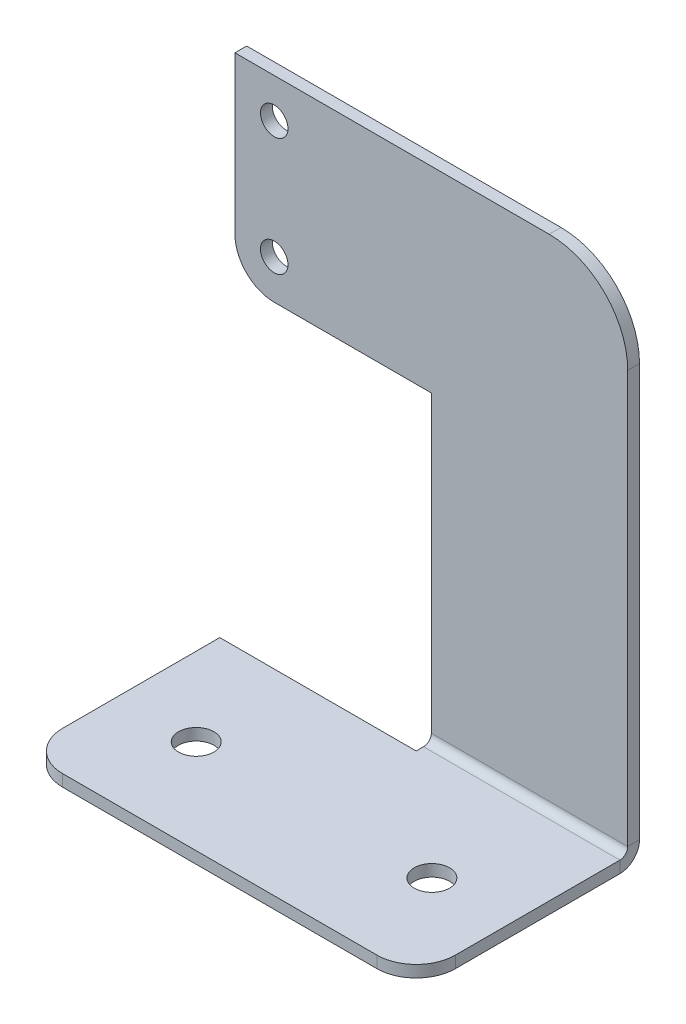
ISO-10303-21;
HEADER;
FILE_DESCRIPTION(('STEP AP214'),'2;1');
FILE_NAME('part.step','',(''),(''),'','','');
FILE_SCHEMA(('AUTOMOTIVE_DESIGN { 1 0 10303 214 1 1 1 1 }'));
ENDSEC;
DATA;
#1=APPLICATION_CONTEXT('core data for automotive mechanical design processes');
#2=APPLICATION_PROTOCOL_DEFINITION('international standard','automotive_design',2000,#1);
#3=PRODUCT_CONTEXT('',#1,'mechanical');
#4=PRODUCT('Part','Part','',(#3));
#5=PRODUCT_RELATED_PRODUCT_CATEGORY('part','',(#4));
#6=PRODUCT_DEFINITION_FORMATION('','',#4);
#7=PRODUCT_DEFINITION_CONTEXT('part definition',#1,'design');
#8=PRODUCT_DEFINITION('design','',#6,#7);
#9=PRODUCT_DEFINITION_SHAPE('','',#8);
#10=(LENGTH_UNIT() NAMED_UNIT(*) SI_UNIT(.MILLI.,.METRE.));
#11=(NAMED_UNIT(*) PLANE_ANGLE_UNIT() SI_UNIT($,.RADIAN.));
#12=(NAMED_UNIT(*) SI_UNIT($,.STERADIAN.) SOLID_ANGLE_UNIT());
#13=UNCERTAINTY_MEASURE_WITH_UNIT(LENGTH_MEASURE(1.E-05),#10,'distance_accuracy_value','');
#14=(GEOMETRIC_REPRESENTATION_CONTEXT(3) GLOBAL_UNCERTAINTY_ASSIGNED_CONTEXT((#13)) GLOBAL_UNIT_ASSIGNED_CONTEXT((#10,
#11,#12)) REPRESENTATION_CONTEXT('',''));
#15=CARTESIAN_POINT('',(0.,0.,0.));
#16=DIRECTION('',(0.,0.,1.));
#17=DIRECTION('',(1.,0.,0.));
#18=AXIS2_PLACEMENT_3D('',#15,#16,#17);
#19=CARTESIAN_POINT('',(5.,24.9999999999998,-41.5708198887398));
#20=DIRECTION('',(0.,-1.,0.));
#21=DIRECTION('',(-1.,0.,0.));
#22=AXIS2_PLACEMENT_3D('',#19,#20,#21);
#23=PLANE('',#22);
#24=CARTESIAN_POINT('',(10.,25.,16.4291801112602));
#25=DIRECTION('',(0.,1.,0.));
#26=DIRECTION('',(1.,0.,0.));
#27=AXIS2_PLACEMENT_3D('',#24,#25,#26);
#28=CIRCLE('',#27,2.25);
#29=CARTESIAN_POINT('',(12.25,25.,16.4291801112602));
#30=VERTEX_POINT('',#29);
#31=EDGE_CURVE('E253',#30,#30,#28,.T.);
#32=ORIENTED_EDGE('',*,*,#31,.T.);
#33=EDGE_LOOP('',(#32));
#34=FACE_BOUND('',#33,.T.);
#35=CARTESIAN_POINT('',(40.,25.,16.4291801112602));
#36=DIRECTION('',(0.,1.,0.));
#37=DIRECTION('',(1.,0.,0.));
#38=AXIS2_PLACEMENT_3D('',#35,#36,#37);
#39=CIRCLE('',#38,2.25);
#40=CARTESIAN_POINT('',(42.25,25.,16.4291801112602));
#41=VERTEX_POINT('',#40);
#42=EDGE_CURVE('E190',#41,#41,#39,.T.);
#43=ORIENTED_EDGE('',*,*,#42,.T.);
#44=EDGE_LOOP('',(#43));
#45=FACE_BOUND('',#44,.T.);
#46=DIRECTION('',(0.,0.,1.));
#47=VECTOR('',#46,1.);
#48=CARTESIAN_POINT('',(25.,24.9999999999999,-36.5708198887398));
#49=LINE('',#48,#47);
#50=CARTESIAN_POINT('',(25.,25.,2.50000000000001));
#51=VERTEX_POINT('',#50);
#52=CARTESIAN_POINT('',(25.,25.,3.4291801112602));
#53=VERTEX_POINT('',#52);
#54=EDGE_CURVE('E53',#51,#53,#49,.T.);
#55=ORIENTED_EDGE('',*,*,#54,.F.);
#56=DIRECTION('',(1.,0.,0.));
#57=VECTOR('',#56,1.);
#58=CARTESIAN_POINT('',(5.,25.,2.5));
#59=LINE('',#58,#57);
#60=CARTESIAN_POINT('',(50.,25.,2.50000000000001));
#61=VERTEX_POINT('',#60);
#62=EDGE_CURVE('E45',#51,#61,#59,.T.);
#63=ORIENTED_EDGE('',*,*,#62,.T.);
#64=DIRECTION('',(0.,0.,-1.));
#65=VECTOR('',#64,1.);
#66=CARTESIAN_POINT('',(50.,25.0000000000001,23.4291801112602));
#67=LINE('',#66,#65);
#68=CARTESIAN_POINT('',(50.,25.0000000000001,23.4291801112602));
#69=VERTEX_POINT('',#68);
#70=EDGE_CURVE('E61',#69,#61,#67,.T.);
#71=ORIENTED_EDGE('',*,*,#70,.F.);
#72=CARTESIAN_POINT('',(45.,25.0000000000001,23.4291801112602));
#73=DIRECTION('',(0.,1.,0.));
#74=DIRECTION('',(1.,0.,0.));
#75=AXIS2_PLACEMENT_3D('',#72,#73,#74);
#76=CIRCLE('',#75,5.);
#77=CARTESIAN_POINT('',(45.,25.0000000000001,28.4291801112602));
#78=VERTEX_POINT('',#77);
#79=EDGE_CURVE('E280',#78,#69,#76,.T.);
#80=ORIENTED_EDGE('',*,*,#79,.F.);
#81=DIRECTION('',(1.,0.,0.));
#82=VECTOR('',#81,1.);
#83=CARTESIAN_POINT('',(5.00000000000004,25.0000000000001,28.4291801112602));
#84=LINE('',#83,#82);
#85=CARTESIAN_POINT('',(5.00000000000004,25.0000000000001,28.4291801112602));
#86=VERTEX_POINT('',#85);
#87=EDGE_CURVE('E278',#86,#78,#84,.T.);
#88=ORIENTED_EDGE('',*,*,#87,.F.);
#89=CARTESIAN_POINT('',(5.,25.0000000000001,23.4291801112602));
#90=DIRECTION('',(0.,1.,0.));
#91=DIRECTION('',(-1.,0.,0.));
#92=AXIS2_PLACEMENT_3D('',#89,#90,#91);
#93=CIRCLE('',#92,5.);
#94=CARTESIAN_POINT('',(0.,25.0000000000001,23.4291801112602));
#95=VERTEX_POINT('',#94);
#96=EDGE_CURVE('E276',#95,#86,#93,.T.);
#97=ORIENTED_EDGE('',*,*,#96,.F.);
#98=DIRECTION('',(0.,0.,1.));
#99=VECTOR('',#98,1.);
#100=CARTESIAN_POINT('',(0.,25.,3.42918011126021));
#101=LINE('',#100,#99);
#102=CARTESIAN_POINT('',(0.,25.,3.42918011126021));
#103=VERTEX_POINT('',#102);
#104=EDGE_CURVE('E274',#103,#95,#101,.T.);
#105=ORIENTED_EDGE('',*,*,#104,.F.);
#106=DIRECTION('',(-1.,0.,0.));
#107=VECTOR('',#106,1.);
#108=CARTESIAN_POINT('',(25.,25.,3.4291801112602));
#109=LINE('',#108,#107);
#110=EDGE_CURVE('E272',#53,#103,#109,.T.);
#111=ORIENTED_EDGE('',*,*,#110,.F.);
#112=EDGE_LOOP('',(#55,#63,#71,#80,#88,#97,#105,#111));
#113=FACE_BOUND('',#112,.T.);
#114=ADVANCED_FACE('F36',(#34,#45,#113),#23,.T.);
#115=CARTESIAN_POINT('',(5.,26.4999999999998,-41.5708198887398));
#116=DIRECTION('',(0.,-1.,0.));
#117=DIRECTION('',(-1.,0.,0.));
#118=AXIS2_PLACEMENT_3D('',#115,#116,#117);
#119=PLANE('',#118);
#120=DIRECTION('',(1.,0.,0.));
#121=VECTOR('',#120,1.);
#122=CARTESIAN_POINT('',(5.,26.5,2.50000000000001));
#123=LINE('',#122,#121);
#124=CARTESIAN_POINT('',(25.,26.5,2.5));
#125=VERTEX_POINT('',#124);
#126=CARTESIAN_POINT('',(50.,26.5,2.50000000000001));
#127=VERTEX_POINT('',#126);
#128=EDGE_CURVE('E299',#125,#127,#123,.T.);
#129=ORIENTED_EDGE('',*,*,#128,.F.);
#130=DIRECTION('',(0.,0.,1.));
#131=VECTOR('',#130,1.);
#132=CARTESIAN_POINT('',(25.,26.4999999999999,-36.5708198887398));
#133=LINE('',#132,#131);
#134=CARTESIAN_POINT('',(25.,26.5,3.4291801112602));
#135=VERTEX_POINT('',#134);
#136=EDGE_CURVE('E40',#125,#135,#133,.T.);
#137=ORIENTED_EDGE('',*,*,#136,.T.);
#138=DIRECTION('',(-1.,0.,0.));
#139=VECTOR('',#138,1.);
#140=CARTESIAN_POINT('',(25.,26.5,3.4291801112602));
#141=LINE('',#140,#139);
#142=CARTESIAN_POINT('',(0.,26.5,3.4291801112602));
#143=VERTEX_POINT('',#142);
#144=EDGE_CURVE('E261',#135,#143,#141,.T.);
#145=ORIENTED_EDGE('',*,*,#144,.T.);
#146=DIRECTION('',(0.,0.,1.));
#147=VECTOR('',#146,1.);
#148=CARTESIAN_POINT('',(0.,26.5,3.4291801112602));
#149=LINE('',#148,#147);
#150=CARTESIAN_POINT('',(0.,26.5000000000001,23.4291801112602));
#151=VERTEX_POINT('',#150);
#152=EDGE_CURVE('E263',#143,#151,#149,.T.);
#153=ORIENTED_EDGE('',*,*,#152,.T.);
#154=CARTESIAN_POINT('',(5.,26.5000000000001,23.4291801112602));
#155=DIRECTION('',(0.,1.,0.));
#156=DIRECTION('',(-1.,0.,0.));
#157=AXIS2_PLACEMENT_3D('',#154,#155,#156);
#158=CIRCLE('',#157,5.);
#159=CARTESIAN_POINT('',(5.00000000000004,26.5000000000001,28.4291801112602));
#160=VERTEX_POINT('',#159);
#161=EDGE_CURVE('E265',#151,#160,#158,.T.);
#162=ORIENTED_EDGE('',*,*,#161,.T.);
#163=DIRECTION('',(1.,0.,0.));
#164=VECTOR('',#163,1.);
#165=CARTESIAN_POINT('',(5.00000000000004,26.5000000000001,28.4291801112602));
#166=LINE('',#165,#164);
#167=CARTESIAN_POINT('',(45.,26.5000000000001,28.4291801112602));
#168=VERTEX_POINT('',#167);
#169=EDGE_CURVE('E267',#160,#168,#166,.T.);
#170=ORIENTED_EDGE('',*,*,#169,.T.);
#171=CARTESIAN_POINT('',(45.,26.5000000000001,23.4291801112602));
#172=DIRECTION('',(0.,1.,0.));
#173=DIRECTION('',(1.,0.,0.));
#174=AXIS2_PLACEMENT_3D('',#171,#172,#173);
#175=CIRCLE('',#174,5.);
#176=CARTESIAN_POINT('',(50.,26.5000000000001,23.4291801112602));
#177=VERTEX_POINT('',#176);
#178=EDGE_CURVE('E269',#168,#177,#175,.T.);
#179=ORIENTED_EDGE('',*,*,#178,.T.);
#180=DIRECTION('',(0.,0.,-1.));
#181=VECTOR('',#180,1.);
#182=CARTESIAN_POINT('',(50.,26.5000000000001,23.4291801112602));
#183=LINE('',#182,#181);
#184=EDGE_CURVE('E271',#177,#127,#183,.T.);
#185=ORIENTED_EDGE('',*,*,#184,.T.);
#186=EDGE_LOOP('',(#129,#137,#145,#153,#162,#170,#179,#185));
#187=FACE_BOUND('',#186,.T.);
#188=CARTESIAN_POINT('',(10.,26.5,16.4291801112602));
#189=DIRECTION('',(0.,1.,0.));
#190=DIRECTION('',(1.,0.,0.));
#191=AXIS2_PLACEMENT_3D('',#188,#189,#190);
#192=CIRCLE('',#191,2.25);
#193=CARTESIAN_POINT('',(12.25,26.5,16.4291801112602));
#194=VERTEX_POINT('',#193);
#195=EDGE_CURVE('E256',#194,#194,#192,.T.);
#196=ORIENTED_EDGE('',*,*,#195,.F.);
#197=EDGE_LOOP('',(#196));
#198=FACE_BOUND('',#197,.T.);
#199=CARTESIAN_POINT('',(40.,26.5,16.4291801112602));
#200=DIRECTION('',(0.,1.,0.));
#201=DIRECTION('',(1.,0.,0.));
#202=AXIS2_PLACEMENT_3D('',#199,#200,#201);
#203=CIRCLE('',#202,2.25);
#204=CARTESIAN_POINT('',(42.25,26.5,16.4291801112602));
#205=VERTEX_POINT('',#204);
#206=EDGE_CURVE('E250',#205,#205,#203,.T.);
#207=ORIENTED_EDGE('',*,*,#206,.F.);
#208=EDGE_LOOP('',(#207));
#209=FACE_BOUND('',#208,.T.);
#210=ADVANCED_FACE('F309',(#187,#198,#209),#119,.F.);
#211=CARTESIAN_POINT('',(25.,26.4999999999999,-36.5708198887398));
#212=DIRECTION('',(1.,0.,0.));
#213=DIRECTION('',(0.,0.,-1.));
#214=AXIS2_PLACEMENT_3D('',#211,#212,#213);
#215=PLANE('',#214);
#216=DIRECTION('',(0.,1.,0.));
#217=VECTOR('',#216,1.);
#218=CARTESIAN_POINT('',(25.,26.4999999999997,2.50000000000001));
#219=LINE('',#218,#217);
#220=EDGE_CURVE('E12',#51,#125,#219,.T.);
#221=ORIENTED_EDGE('',*,*,#220,.F.);
#222=ORIENTED_EDGE('',*,*,#54,.T.);
#223=DIRECTION('',(0.,-1.,0.));
#224=VECTOR('',#223,1.);
#225=CARTESIAN_POINT('',(25.,26.5,3.4291801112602));
#226=LINE('',#225,#224);
#227=EDGE_CURVE('E296',#135,#53,#226,.T.);
#228=ORIENTED_EDGE('',*,*,#227,.F.);
#229=ORIENTED_EDGE('',*,*,#136,.F.);
#230=EDGE_LOOP('',(#221,#222,#228,#229));
#231=FACE_BOUND('',#230,.T.);
#232=ADVANCED_FACE('F38',(#231),#215,.F.);
#233=CARTESIAN_POINT('',(25.,26.5,3.4291801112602));
#234=DIRECTION('',(0.,0.,1.));
#235=DIRECTION('',(1.,0.,0.));
#236=AXIS2_PLACEMENT_3D('',#233,#234,#235);
#237=PLANE('',#236);
#238=ORIENTED_EDGE('',*,*,#110,.T.);
#239=DIRECTION('',(0.,-1.,0.));
#240=VECTOR('',#239,1.);
#241=CARTESIAN_POINT('',(0.,26.5,3.4291801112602));
#242=LINE('',#241,#240);
#243=EDGE_CURVE('E293',#143,#103,#242,.T.);
#244=ORIENTED_EDGE('',*,*,#243,.F.);
#245=ORIENTED_EDGE('',*,*,#144,.F.);
#246=ORIENTED_EDGE('',*,*,#227,.T.);
#247=EDGE_LOOP('',(#238,#244,#245,#246));
#248=FACE_BOUND('',#247,.T.);
#249=ADVANCED_FACE('F376',(#248),#237,.F.);
#250=CARTESIAN_POINT('',(0.,26.5,3.4291801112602));
#251=DIRECTION('',(1.,0.,0.));
#252=DIRECTION('',(0.,0.,-1.));
#253=AXIS2_PLACEMENT_3D('',#250,#251,#252);
#254=PLANE('',#253);
#255=ORIENTED_EDGE('',*,*,#104,.T.);
#256=DIRECTION('',(0.,-1.,0.));
#257=VECTOR('',#256,1.);
#258=CARTESIAN_POINT('',(0.,26.5000000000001,23.4291801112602));
#259=LINE('',#258,#257);
#260=EDGE_CURVE('E290',#151,#95,#259,.T.);
#261=ORIENTED_EDGE('',*,*,#260,.F.);
#262=ORIENTED_EDGE('',*,*,#152,.F.);
#263=ORIENTED_EDGE('',*,*,#243,.T.);
#264=EDGE_LOOP('',(#255,#261,#262,#263));
#265=FACE_BOUND('',#264,.T.);
#266=ADVANCED_FACE('F372',(#265),#254,.F.);
#267=CARTESIAN_POINT('',(5.,26.5000000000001,23.4291801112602));
#268=DIRECTION('',(0.,-1.,0.));
#269=DIRECTION('',(-1.,0.,0.));
#270=AXIS2_PLACEMENT_3D('',#267,#268,#269);
#271=CYLINDRICAL_SURFACE('',#270,5.);
#272=ORIENTED_EDGE('',*,*,#96,.T.);
#273=DIRECTION('',(0.,-1.,0.));
#274=VECTOR('',#273,1.);
#275=CARTESIAN_POINT('',(5.00000000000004,26.5000000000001,28.4291801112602));
#276=LINE('',#275,#274);
#277=EDGE_CURVE('E287',#160,#86,#276,.T.);
#278=ORIENTED_EDGE('',*,*,#277,.F.);
#279=ORIENTED_EDGE('',*,*,#161,.F.);
#280=ORIENTED_EDGE('',*,*,#260,.T.);
#281=EDGE_LOOP('',(#272,#278,#279,#280));
#282=FACE_BOUND('',#281,.T.);
#283=ADVANCED_FACE('F368',(#282),#271,.T.);
#284=CARTESIAN_POINT('',(5.00000000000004,26.5000000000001,28.4291801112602));
#285=DIRECTION('',(0.,0.,-1.));
#286=DIRECTION('',(0.,1.,0.));
#287=AXIS2_PLACEMENT_3D('',#284,#285,#286);
#288=PLANE('',#287);
#289=ORIENTED_EDGE('',*,*,#87,.T.);
#290=DIRECTION('',(0.,-1.,0.));
#291=VECTOR('',#290,1.);
#292=CARTESIAN_POINT('',(45.,26.5000000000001,28.4291801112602));
#293=LINE('',#292,#291);
#294=EDGE_CURVE('E284',#168,#78,#293,.T.);
#295=ORIENTED_EDGE('',*,*,#294,.F.);
#296=ORIENTED_EDGE('',*,*,#169,.F.);
#297=ORIENTED_EDGE('',*,*,#277,.T.);
#298=EDGE_LOOP('',(#289,#295,#296,#297));
#299=FACE_BOUND('',#298,.T.);
#300=ADVANCED_FACE('F341',(#299),#288,.F.);
#301=CARTESIAN_POINT('',(45.,26.5000000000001,23.4291801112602));
#302=DIRECTION('',(0.,-1.,0.));
#303=DIRECTION('',(-1.,0.,0.));
#304=AXIS2_PLACEMENT_3D('',#301,#302,#303);
#305=CYLINDRICAL_SURFACE('',#304,5.);
#306=ORIENTED_EDGE('',*,*,#79,.T.);
#307=DIRECTION('',(0.,-1.,0.));
#308=VECTOR('',#307,1.);
#309=CARTESIAN_POINT('',(50.,26.5000000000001,23.4291801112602));
#310=LINE('',#309,#308);
#311=EDGE_CURVE('E282',#177,#69,#310,.T.);
#312=ORIENTED_EDGE('',*,*,#311,.F.);
#313=ORIENTED_EDGE('',*,*,#178,.F.);
#314=ORIENTED_EDGE('',*,*,#294,.T.);
#315=EDGE_LOOP('',(#306,#312,#313,#314));
#316=FACE_BOUND('',#315,.T.);
#317=ADVANCED_FACE('F328',(#316),#305,.T.);
#318=CARTESIAN_POINT('',(50.,26.5000000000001,23.4291801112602));
#319=DIRECTION('',(-1.,0.,0.));
#320=DIRECTION('',(0.,1.,0.));
#321=AXIS2_PLACEMENT_3D('',#318,#319,#320);
#322=PLANE('',#321);
#323=DIRECTION('',(0.,-1.,0.));
#324=VECTOR('',#323,1.);
#325=CARTESIAN_POINT('',(50.,26.5000000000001,2.50000000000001));
#326=LINE('',#325,#324);
#327=EDGE_CURVE('E301',#127,#61,#326,.T.);
#328=ORIENTED_EDGE('',*,*,#327,.F.);
#329=ORIENTED_EDGE('',*,*,#184,.F.);
#330=ORIENTED_EDGE('',*,*,#311,.T.);
#331=ORIENTED_EDGE('',*,*,#70,.T.);
#332=EDGE_LOOP('',(#328,#329,#330,#331));
#333=FACE_BOUND('',#332,.T.);
#334=ADVANCED_FACE('F330',(#333),#322,.F.);
#335=CARTESIAN_POINT('',(10.,26.5,16.4291801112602));
#336=DIRECTION('',(0.,-1.,0.));
#337=DIRECTION('',(-1.,0.,0.));
#338=AXIS2_PLACEMENT_3D('',#335,#336,#337);
#339=CYLINDRICAL_SURFACE('',#338,2.25);
#340=ORIENTED_EDGE('',*,*,#195,.T.);
#341=EDGE_LOOP('',(#340));
#342=FACE_BOUND('',#341,.T.);
#343=ORIENTED_EDGE('',*,*,#31,.F.);
#344=EDGE_LOOP('',(#343));
#345=FACE_BOUND('',#344,.T.);
#346=ADVANCED_FACE('F332',(#342,#345),#339,.F.);
#347=CARTESIAN_POINT('',(40.,26.5,16.4291801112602));
#348=DIRECTION('',(0.,-1.,0.));
#349=DIRECTION('',(-1.,0.,0.));
#350=AXIS2_PLACEMENT_3D('',#347,#348,#349);
#351=CYLINDRICAL_SURFACE('',#350,2.25);
#352=ORIENTED_EDGE('',*,*,#206,.T.);
#353=EDGE_LOOP('',(#352));
#354=FACE_BOUND('',#353,.T.);
#355=ORIENTED_EDGE('',*,*,#42,.F.);
#356=EDGE_LOOP('',(#355));
#357=FACE_BOUND('',#356,.T.);
#358=ADVANCED_FACE('F338',(#354,#357),#351,.F.);
#359=CARTESIAN_POINT('',(5.00000000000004,65.,1.5));
#360=DIRECTION('',(0.,1.,0.));
#361=DIRECTION('',(0.,0.,1.));
#362=AXIS2_PLACEMENT_3D('',#359,#360,#361);
#363=PLANE('',#362);
#364=DIRECTION('',(1.,0.,0.));
#365=VECTOR('',#364,1.);
#366=CARTESIAN_POINT('',(5.00000000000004,65.,0.));
#367=LINE('',#366,#365);
#368=CARTESIAN_POINT('',(5.00000000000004,65.,0.));
#369=VERTEX_POINT('',#368);
#370=CARTESIAN_POINT('',(25.,65.,0.));
#371=VERTEX_POINT('',#370);
#372=EDGE_CURVE('E246',#369,#371,#367,.T.);
#373=ORIENTED_EDGE('',*,*,#372,.T.);
#374=DIRECTION('',(0.,0.,-1.));
#375=VECTOR('',#374,1.);
#376=CARTESIAN_POINT('',(25.,65.,1.5));
#377=LINE('',#376,#375);
#378=CARTESIAN_POINT('',(25.,65.,1.5));
#379=VERTEX_POINT('',#378);
#380=EDGE_CURVE('E188',#379,#371,#377,.T.);
#381=ORIENTED_EDGE('',*,*,#380,.F.);
#382=DIRECTION('',(1.,0.,0.));
#383=VECTOR('',#382,1.);
#384=CARTESIAN_POINT('',(5.00000000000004,65.,1.5));
#385=LINE('',#384,#383);
#386=CARTESIAN_POINT('',(5.00000000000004,65.,1.5));
#387=VERTEX_POINT('',#386);
#388=EDGE_CURVE('E177',#387,#379,#385,.T.);
#389=ORIENTED_EDGE('',*,*,#388,.F.);
#390=DIRECTION('',(0.,0.,-1.));
#391=VECTOR('',#390,1.);
#392=CARTESIAN_POINT('',(5.00000000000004,65.,1.5));
#393=LINE('',#392,#391);
#394=EDGE_CURVE('E243',#387,#369,#393,.T.);
#395=ORIENTED_EDGE('',*,*,#394,.T.);
#396=EDGE_LOOP('',(#373,#381,#389,#395));
#397=FACE_BOUND('',#396,.T.);
#398=ADVANCED_FACE('F354',(#397),#363,.F.);
#399=CARTESIAN_POINT('',(5.,70.,1.5));
#400=DIRECTION('',(0.,0.,-1.));
#401=DIRECTION('',(-1.,0.,0.));
#402=AXIS2_PLACEMENT_3D('',#399,#400,#401);
#403=CYLINDRICAL_SURFACE('',#402,5.);
#404=CARTESIAN_POINT('',(5.,70.,0.));
#405=DIRECTION('',(0.,0.,1.));
#406=DIRECTION('',(-1.,0.,0.));
#407=AXIS2_PLACEMENT_3D('',#404,#405,#406);
#408=CIRCLE('',#407,5.);
#409=CARTESIAN_POINT('',(0.,70.,0.));
#410=VERTEX_POINT('',#409);
#411=EDGE_CURVE('E241',#410,#369,#408,.T.);
#412=ORIENTED_EDGE('',*,*,#411,.T.);
#413=ORIENTED_EDGE('',*,*,#394,.F.);
#414=CARTESIAN_POINT('',(5.,70.,1.5));
#415=DIRECTION('',(0.,0.,1.));
#416=DIRECTION('',(-1.,0.,0.));
#417=AXIS2_PLACEMENT_3D('',#414,#415,#416);
#418=CIRCLE('',#417,5.);
#419=CARTESIAN_POINT('',(0.,70.,1.5));
#420=VERTEX_POINT('',#419);
#421=EDGE_CURVE('E207',#420,#387,#418,.T.);
#422=ORIENTED_EDGE('',*,*,#421,.F.);
#423=DIRECTION('',(0.,0.,-1.));
#424=VECTOR('',#423,1.);
#425=CARTESIAN_POINT('',(0.,70.,1.5));
#426=LINE('',#425,#424);
#427=EDGE_CURVE('E238',#420,#410,#426,.T.);
#428=ORIENTED_EDGE('',*,*,#427,.T.);
#429=EDGE_LOOP('',(#412,#413,#422,#428));
#430=FACE_BOUND('',#429,.T.);
#431=ADVANCED_FACE('F360',(#430),#403,.T.);
#432=CARTESIAN_POINT('',(0.,90.,1.5));
#433=DIRECTION('',(1.,0.,0.));
#434=DIRECTION('',(0.,1.,0.));
#435=AXIS2_PLACEMENT_3D('',#432,#433,#434);
#436=PLANE('',#435);
#437=DIRECTION('',(0.,-1.,0.));
#438=VECTOR('',#437,1.);
#439=CARTESIAN_POINT('',(0.,90.,0.));
#440=LINE('',#439,#438);
#441=CARTESIAN_POINT('',(0.,90.,0.));
#442=VERTEX_POINT('',#441);
#443=EDGE_CURVE('E235',#442,#410,#440,.T.);
#444=ORIENTED_EDGE('',*,*,#443,.T.);
#445=ORIENTED_EDGE('',*,*,#427,.F.);
#446=DIRECTION('',(0.,-1.,0.));
#447=VECTOR('',#446,1.);
#448=CARTESIAN_POINT('',(0.,90.,1.5));
#449=LINE('',#448,#447);
#450=CARTESIAN_POINT('',(0.,90.,1.5));
#451=VERTEX_POINT('',#450);
#452=EDGE_CURVE('E209',#451,#420,#449,.T.);
#453=ORIENTED_EDGE('',*,*,#452,.F.);
#454=DIRECTION('',(0.,0.,-1.));
#455=VECTOR('',#454,1.);
#456=CARTESIAN_POINT('',(0.,90.,1.5));
#457=LINE('',#456,#455);
#458=EDGE_CURVE('E232',#451,#442,#457,.T.);
#459=ORIENTED_EDGE('',*,*,#458,.T.);
#460=EDGE_LOOP('',(#444,#445,#453,#459));
#461=FACE_BOUND('',#460,.T.);
#462=ADVANCED_FACE('F483',(#461),#436,.F.);
#463=CARTESIAN_POINT('',(39.9999999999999,90.,1.5));
#464=DIRECTION('',(0.,-1.,0.));
#465=DIRECTION('',(0.,0.,-1.));
#466=AXIS2_PLACEMENT_3D('',#463,#464,#465);
#467=PLANE('',#466);
#468=DIRECTION('',(-1.,0.,0.));
#469=VECTOR('',#468,1.);
#470=CARTESIAN_POINT('',(39.9999999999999,90.,0.));
#471=LINE('',#470,#469);
#472=CARTESIAN_POINT('',(39.9999999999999,90.,0.));
#473=VERTEX_POINT('',#472);
#474=EDGE_CURVE('E230',#473,#442,#471,.T.);
#475=ORIENTED_EDGE('',*,*,#474,.T.);
#476=ORIENTED_EDGE('',*,*,#458,.F.);
#477=DIRECTION('',(-1.,0.,0.));
#478=VECTOR('',#477,1.);
#479=CARTESIAN_POINT('',(39.9999999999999,90.,1.5));
#480=LINE('',#479,#478);
#481=CARTESIAN_POINT('',(39.9999999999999,90.,1.5));
#482=VERTEX_POINT('',#481);
#483=EDGE_CURVE('E212',#482,#451,#480,.T.);
#484=ORIENTED_EDGE('',*,*,#483,.F.);
#485=DIRECTION('',(0.,0.,-1.));
#486=VECTOR('',#485,1.);
#487=CARTESIAN_POINT('',(39.9999999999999,90.,1.5));
#488=LINE('',#487,#486);
#489=EDGE_CURVE('E227',#482,#473,#488,.T.);
#490=ORIENTED_EDGE('',*,*,#489,.T.);
#491=EDGE_LOOP('',(#475,#476,#484,#490));
#492=FACE_BOUND('',#491,.T.);
#493=ADVANCED_FACE('F472',(#492),#467,.F.);
#494=CARTESIAN_POINT('',(40.,80.,1.5));
#495=DIRECTION('',(0.,0.,-1.));
#496=DIRECTION('',(-1.,0.,0.));
#497=AXIS2_PLACEMENT_3D('',#494,#495,#496);
#498=CYLINDRICAL_SURFACE('',#497,9.99999999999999);
#499=CARTESIAN_POINT('',(40.,80.,0.));
#500=DIRECTION('',(0.,0.,1.));
#501=DIRECTION('',(1.,0.,0.));
#502=AXIS2_PLACEMENT_3D('',#499,#500,#501);
#503=CIRCLE('',#502,9.99999999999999);
#504=CARTESIAN_POINT('',(50.,79.9999999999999,0.));
#505=VERTEX_POINT('',#504);
#506=EDGE_CURVE('E225',#505,#473,#503,.T.);
#507=ORIENTED_EDGE('',*,*,#506,.T.);
#508=ORIENTED_EDGE('',*,*,#489,.F.);
#509=CARTESIAN_POINT('',(40.,80.,1.5));
#510=DIRECTION('',(0.,0.,1.));
#511=DIRECTION('',(1.,0.,0.));
#512=AXIS2_PLACEMENT_3D('',#509,#510,#511);
#513=CIRCLE('',#512,9.99999999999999);
#514=CARTESIAN_POINT('',(50.,79.9999999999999,1.5));
#515=VERTEX_POINT('',#514);
#516=EDGE_CURVE('E214',#515,#482,#513,.T.);
#517=ORIENTED_EDGE('',*,*,#516,.F.);
#518=DIRECTION('',(0.,0.,-1.));
#519=VECTOR('',#518,1.);
#520=CARTESIAN_POINT('',(50.,79.9999999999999,1.5));
#521=LINE('',#520,#519);
#522=EDGE_CURVE('E222',#515,#505,#521,.T.);
#523=ORIENTED_EDGE('',*,*,#522,.T.);
#524=EDGE_LOOP('',(#507,#508,#517,#523));
#525=FACE_BOUND('',#524,.T.);
#526=ADVANCED_FACE('F461',(#525),#498,.T.);
#527=CARTESIAN_POINT('',(5.,85.,1.5));
#528=DIRECTION('',(0.,0.,-1.));
#529=DIRECTION('',(-1.,0.,0.));
#530=AXIS2_PLACEMENT_3D('',#527,#528,#529);
#531=CYLINDRICAL_SURFACE('',#530,1.75);
#532=CARTESIAN_POINT('',(5.,85.,1.5));
#533=DIRECTION('',(0.,0.,1.));
#534=DIRECTION('',(1.,0.,0.));
#535=AXIS2_PLACEMENT_3D('',#532,#533,#534);
#536=CIRCLE('',#535,1.75);
#537=CARTESIAN_POINT('',(6.75,85.,1.5));
#538=VERTEX_POINT('',#537);
#539=EDGE_CURVE('E219',#538,#538,#536,.T.);
#540=ORIENTED_EDGE('',*,*,#539,.T.);
#541=EDGE_LOOP('',(#540));
#542=FACE_BOUND('',#541,.T.);
#543=CARTESIAN_POINT('',(5.,85.,0.));
#544=DIRECTION('',(0.,0.,1.));
#545=DIRECTION('',(1.,0.,0.));
#546=AXIS2_PLACEMENT_3D('',#543,#544,#545);
#547=CIRCLE('',#546,1.75);
#548=CARTESIAN_POINT('',(6.75,85.,0.));
#549=VERTEX_POINT('',#548);
#550=EDGE_CURVE('E198',#549,#549,#547,.T.);
#551=ORIENTED_EDGE('',*,*,#550,.F.);
#552=EDGE_LOOP('',(#551));
#553=FACE_BOUND('',#552,.T.);
#554=ADVANCED_FACE('F450',(#542,#553),#531,.F.);
#555=CARTESIAN_POINT('',(5.,70.,1.5));
#556=DIRECTION('',(0.,0.,-1.));
#557=DIRECTION('',(-1.,0.,0.));
#558=AXIS2_PLACEMENT_3D('',#555,#556,#557);
#559=CYLINDRICAL_SURFACE('',#558,1.75);
#560=CARTESIAN_POINT('',(5.,70.,1.5));
#561=DIRECTION('',(0.,0.,1.));
#562=DIRECTION('',(1.,0.,0.));
#563=AXIS2_PLACEMENT_3D('',#560,#561,#562);
#564=CIRCLE('',#563,1.75);
#565=CARTESIAN_POINT('',(6.75000000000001,70.,1.5));
#566=VERTEX_POINT('',#565);
#567=EDGE_CURVE('E181',#566,#566,#564,.T.);
#568=ORIENTED_EDGE('',*,*,#567,.T.);
#569=EDGE_LOOP('',(#568));
#570=FACE_BOUND('',#569,.T.);
#571=CARTESIAN_POINT('',(5.,70.,0.));
#572=DIRECTION('',(0.,0.,1.));
#573=DIRECTION('',(1.,0.,0.));
#574=AXIS2_PLACEMENT_3D('',#571,#572,#573);
#575=CIRCLE('',#574,1.75);
#576=CARTESIAN_POINT('',(6.75000000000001,70.,0.));
#577=VERTEX_POINT('',#576);
#578=EDGE_CURVE('E192',#577,#577,#575,.T.);
#579=ORIENTED_EDGE('',*,*,#578,.F.);
#580=EDGE_LOOP('',(#579));
#581=FACE_BOUND('',#580,.T.);
#582=ADVANCED_FACE('F439',(#570,#581),#559,.F.);
#583=CARTESIAN_POINT('',(5.,70.,1.5));
#584=DIRECTION('',(0.,0.,-1.));
#585=DIRECTION('',(-1.,0.,0.));
#586=AXIS2_PLACEMENT_3D('',#583,#584,#585);
#587=PLANE('',#586);
#588=ORIENTED_EDGE('',*,*,#567,.F.);
#589=EDGE_LOOP('',(#588));
#590=FACE_BOUND('',#589,.T.);
#591=ORIENTED_EDGE('',*,*,#539,.F.);
#592=EDGE_LOOP('',(#591));
#593=FACE_BOUND('',#592,.T.);
#594=DIRECTION('',(0.,-1.,0.));
#595=VECTOR('',#594,1.);
#596=CARTESIAN_POINT('',(25.,65.,1.5));
#597=LINE('',#596,#595);
#598=CARTESIAN_POINT('',(25.,27.5,1.5));
#599=VERTEX_POINT('',#598);
#600=EDGE_CURVE('E172',#379,#599,#597,.T.);
#601=ORIENTED_EDGE('',*,*,#600,.T.);
#602=DIRECTION('',(1.,0.,0.));
#603=VECTOR('',#602,1.);
#604=CARTESIAN_POINT('',(5.,27.5,1.5));
#605=LINE('',#604,#603);
#606=CARTESIAN_POINT('',(50.,27.5,1.5));
#607=VERTEX_POINT('',#606);
#608=EDGE_CURVE('E165',#599,#607,#605,.T.);
#609=ORIENTED_EDGE('',*,*,#608,.T.);
#610=DIRECTION('',(0.,1.,0.));
#611=VECTOR('',#610,1.);
#612=CARTESIAN_POINT('',(50.,5.00000000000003,1.5));
#613=LINE('',#612,#611);
#614=EDGE_CURVE('E171',#607,#515,#613,.T.);
#615=ORIENTED_EDGE('',*,*,#614,.T.);
#616=ORIENTED_EDGE('',*,*,#516,.T.);
#617=ORIENTED_EDGE('',*,*,#483,.T.);
#618=ORIENTED_EDGE('',*,*,#452,.T.);
#619=ORIENTED_EDGE('',*,*,#421,.T.);
#620=ORIENTED_EDGE('',*,*,#388,.T.);
#621=EDGE_LOOP('',(#601,#609,#615,#616,#617,#618,#619,#620));
#622=FACE_BOUND('',#621,.T.);
#623=ADVANCED_FACE('F175',(#590,#593,#622),#587,.F.);
#624=CARTESIAN_POINT('',(50.,5.00000000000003,1.5));
#625=DIRECTION('',(-1.,0.,0.));
#626=DIRECTION('',(0.,0.,1.));
#627=AXIS2_PLACEMENT_3D('',#624,#625,#626);
#628=PLANE('',#627);
#629=ORIENTED_EDGE('',*,*,#614,.F.);
#630=DIRECTION('',(0.,0.,-1.));
#631=VECTOR('',#630,1.);
#632=CARTESIAN_POINT('',(50.,27.5,1.50000000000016));
#633=LINE('',#632,#631);
#634=CARTESIAN_POINT('',(50.,27.5,0.));
#635=VERTEX_POINT('',#634);
#636=EDGE_CURVE('E203',#607,#635,#633,.T.);
#637=ORIENTED_EDGE('',*,*,#636,.T.);
#638=DIRECTION('',(0.,1.,0.));
#639=VECTOR('',#638,1.);
#640=CARTESIAN_POINT('',(50.,5.00000000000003,0.));
#641=LINE('',#640,#639);
#642=EDGE_CURVE('E201',#635,#505,#641,.T.);
#643=ORIENTED_EDGE('',*,*,#642,.T.);
#644=ORIENTED_EDGE('',*,*,#522,.F.);
#645=EDGE_LOOP('',(#629,#637,#643,#644));
#646=FACE_BOUND('',#645,.T.);
#647=ADVANCED_FACE('F424',(#646),#628,.F.);
#648=CARTESIAN_POINT('',(5.,70.,0.));
#649=DIRECTION('',(0.,0.,-1.));
#650=DIRECTION('',(-1.,0.,0.));
#651=AXIS2_PLACEMENT_3D('',#648,#649,#650);
#652=PLANE('',#651);
#653=DIRECTION('',(1.,0.,0.));
#654=VECTOR('',#653,1.);
#655=CARTESIAN_POINT('',(5.,27.5,0.));
#656=LINE('',#655,#654);
#657=CARTESIAN_POINT('',(25.,27.5,0.));
#658=VERTEX_POINT('',#657);
#659=EDGE_CURVE('E248',#658,#635,#656,.T.);
#660=ORIENTED_EDGE('',*,*,#659,.F.);
#661=DIRECTION('',(0.,-1.,0.));
#662=VECTOR('',#661,1.);
#663=CARTESIAN_POINT('',(25.,65.,0.));
#664=LINE('',#663,#662);
#665=EDGE_CURVE('E186',#371,#658,#664,.T.);
#666=ORIENTED_EDGE('',*,*,#665,.F.);
#667=ORIENTED_EDGE('',*,*,#372,.F.);
#668=ORIENTED_EDGE('',*,*,#411,.F.);
#669=ORIENTED_EDGE('',*,*,#443,.F.);
#670=ORIENTED_EDGE('',*,*,#474,.F.);
#671=ORIENTED_EDGE('',*,*,#506,.F.);
#672=ORIENTED_EDGE('',*,*,#642,.F.);
#673=EDGE_LOOP('',(#660,#666,#667,#668,#669,#670,#671,#672));
#674=FACE_BOUND('',#673,.T.);
#675=ORIENTED_EDGE('',*,*,#550,.T.);
#676=EDGE_LOOP('',(#675));
#677=FACE_BOUND('',#676,.T.);
#678=ORIENTED_EDGE('',*,*,#578,.T.);
#679=EDGE_LOOP('',(#678));
#680=FACE_BOUND('',#679,.T.);
#681=ADVANCED_FACE('F419',(#674,#677,#680),#652,.T.);
#682=CARTESIAN_POINT('',(25.,65.,1.5));
#683=DIRECTION('',(1.,0.,0.));
#684=DIRECTION('',(0.,1.,0.));
#685=AXIS2_PLACEMENT_3D('',#682,#683,#684);
#686=PLANE('',#685);
#687=ORIENTED_EDGE('',*,*,#665,.T.);
#688=DIRECTION('',(0.,0.,1.));
#689=VECTOR('',#688,1.);
#690=CARTESIAN_POINT('',(25.,27.5,1.49999999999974));
#691=LINE('',#690,#689);
#692=EDGE_CURVE('E156',#658,#599,#691,.T.);
#693=ORIENTED_EDGE('',*,*,#692,.T.);
#694=ORIENTED_EDGE('',*,*,#600,.F.);
#695=ORIENTED_EDGE('',*,*,#380,.T.);
#696=EDGE_LOOP('',(#687,#693,#694,#695));
#697=FACE_BOUND('',#696,.T.);
#698=ADVANCED_FACE('F184',(#697),#686,.F.);
#699=CARTESIAN_POINT('',(25.,27.5,2.5));
#700=DIRECTION('',(1.,0.,0.));
#701=DIRECTION('',(0.,0.,-1.));
#702=AXIS2_PLACEMENT_3D('',#699,#700,#701);
#703=PLANE('',#702);
#704=ORIENTED_EDGE('',*,*,#692,.F.);
#705=CARTESIAN_POINT('',(25.,27.5,2.5));
#706=DIRECTION('',(1.,0.,0.));
#707=DIRECTION('',(0.,0.,-1.));
#708=AXIS2_PLACEMENT_3D('',#705,#706,#707);
#709=CIRCLE('',#708,2.5);
#710=EDGE_CURVE('E320',#658,#51,#709,.F.);
#711=ORIENTED_EDGE('',*,*,#710,.T.);
#712=ORIENTED_EDGE('',*,*,#220,.T.);
#713=CARTESIAN_POINT('',(25.,27.5,2.5));
#714=DIRECTION('',(-1.,0.,0.));
#715=DIRECTION('',(0.,0.,1.));
#716=AXIS2_PLACEMENT_3D('',#713,#714,#715);
#717=CIRCLE('',#716,1.);
#718=EDGE_CURVE('E151',#599,#125,#717,.T.);
#719=ORIENTED_EDGE('',*,*,#718,.F.);
#720=EDGE_LOOP('',(#704,#711,#712,#719));
#721=FACE_BOUND('',#720,.T.);
#722=ADVANCED_FACE('F153',(#721),#703,.F.);
#723=CARTESIAN_POINT('',(50.,27.5,2.5));
#724=DIRECTION('',(-1.,0.,0.));
#725=DIRECTION('',(0.,0.,1.));
#726=AXIS2_PLACEMENT_3D('',#723,#724,#725);
#727=PLANE('',#726);
#728=ORIENTED_EDGE('',*,*,#327,.T.);
#729=CARTESIAN_POINT('',(50.,27.5,2.5));
#730=DIRECTION('',(1.,0.,0.));
#731=DIRECTION('',(0.,0.,-1.));
#732=AXIS2_PLACEMENT_3D('',#729,#730,#731);
#733=CIRCLE('',#732,2.5);
#734=EDGE_CURVE('E161',#61,#635,#733,.T.);
#735=ORIENTED_EDGE('',*,*,#734,.T.);
#736=ORIENTED_EDGE('',*,*,#636,.F.);
#737=CARTESIAN_POINT('',(50.,27.5,2.5));
#738=DIRECTION('',(1.,0.,0.));
#739=DIRECTION('',(0.,0.,-1.));
#740=AXIS2_PLACEMENT_3D('',#737,#738,#739);
#741=CIRCLE('',#740,1.);
#742=EDGE_CURVE('E160',#127,#607,#741,.T.);
#743=ORIENTED_EDGE('',*,*,#742,.F.);
#744=EDGE_LOOP('',(#728,#735,#736,#743));
#745=FACE_BOUND('',#744,.T.);
#746=ADVANCED_FACE('F315',(#745),#727,.F.);
#747=CARTESIAN_POINT('',(12.4058278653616,27.5,2.5));
#748=DIRECTION('',(1.,0.,0.));
#749=DIRECTION('',(0.,0.,-1.));
#750=AXIS2_PLACEMENT_3D('',#747,#748,#749);
#751=CYLINDRICAL_SURFACE('',#750,1.);
#752=ORIENTED_EDGE('',*,*,#742,.T.);
#753=ORIENTED_EDGE('',*,*,#608,.F.);
#754=ORIENTED_EDGE('',*,*,#718,.T.);
#755=ORIENTED_EDGE('',*,*,#128,.T.);
#756=EDGE_LOOP('',(#752,#753,#754,#755));
#757=FACE_BOUND('',#756,.T.);
#758=ADVANCED_FACE('F167',(#757),#751,.F.);
#759=CARTESIAN_POINT('',(12.4058278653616,27.5,2.5));
#760=DIRECTION('',(1.,0.,0.));
#761=DIRECTION('',(0.,0.,-1.));
#762=AXIS2_PLACEMENT_3D('',#759,#760,#761);
#763=CYLINDRICAL_SURFACE('',#762,2.5);
#764=ORIENTED_EDGE('',*,*,#734,.F.);
#765=ORIENTED_EDGE('',*,*,#62,.F.);
#766=ORIENTED_EDGE('',*,*,#710,.F.);
#767=ORIENTED_EDGE('',*,*,#659,.T.);
#768=EDGE_LOOP('',(#764,#765,#766,#767));
#769=FACE_BOUND('',#768,.T.);
#770=ADVANCED_FACE('F323',(#769),#763,.T.);
#771=CLOSED_SHELL('',(#114,#210,#232,#249,#266,#283,#300,#317,#334,#346,#358,#398,#431,#462,
#493,#526,#554,#582,#623,#647,#681,#698,#722,#746,#758,#770));
#772=MANIFOLD_SOLID_BREP('B2',#771);
#773=ADVANCED_BREP_SHAPE_REPRESENTATION('',(#18,#772),#14);
#774=SHAPE_DEFINITION_REPRESENTATION(#9,#773);
ENDSEC;
END-ISO-10303-21;
